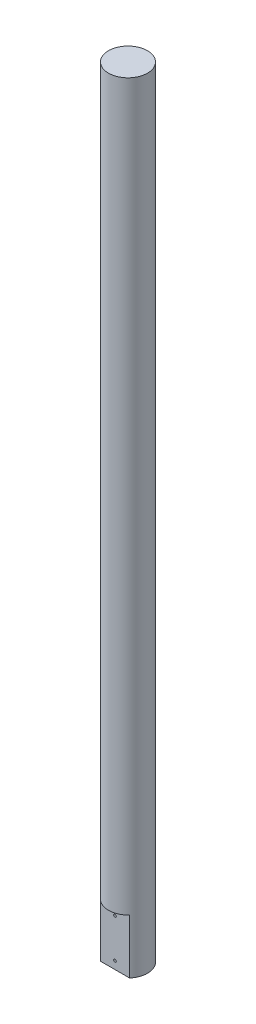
from build123d import *

# Parameters (mm, degrees)
ESQUISSE1_R             = 7.5
EXTRUSION1_DEPTH        = 300
ESQUISSE2_W             = 3.220394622
ESQUISSE2_H             = 22.042115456
ENL_V_MAT_EXTRU_1_DEPTH = 10
ESQUISSE3_R             = 0.5
ENL_V_MAT_EXTRU_2_DEPTH = 1


with BuildPart() as part:
    # Esquisse1 → Extrusion1 (new body)
    with BuildSketch(Plane(origin=(0, 0, 0), x_dir=(1, 0, 0), z_dir=(0, 1, 0))):
        with Locations(Location((0, 0, 0), (0, 0, 270))):
            Circle(ESQUISSE1_R)
    extrude(amount=EXTRUSION1_DEPTH)

    # Esquisse2 → Enl_v. mat.-Extru.1 (cut, symmetric)
    with BuildSketch(Plane(origin=(0, 0, 0), x_dir=(0, 0, -1), z_dir=(1, 0, 0))):
        with Locations((-6.610197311, 9.978942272)):
            Rectangle(ESQUISSE2_W, ESQUISSE2_H)
    extrude(amount=ENL_V_MAT_EXTRU_1_DEPTH, both=True, mode=Mode.SUBTRACT)

    # Esquisse3 → Enl_v. mat.-Extru.2 (cut)
    with BuildSketch(Plane.XY.offset(5)):
        with Locations((0, 3)):
            Circle(ESQUISSE3_R)
        with Locations((0, 18)):
            Circle(ESQUISSE3_R)
    extrude(amount=-ENL_V_MAT_EXTRU_2_DEPTH, mode=Mode.SUBTRACT)


solid = part.part
